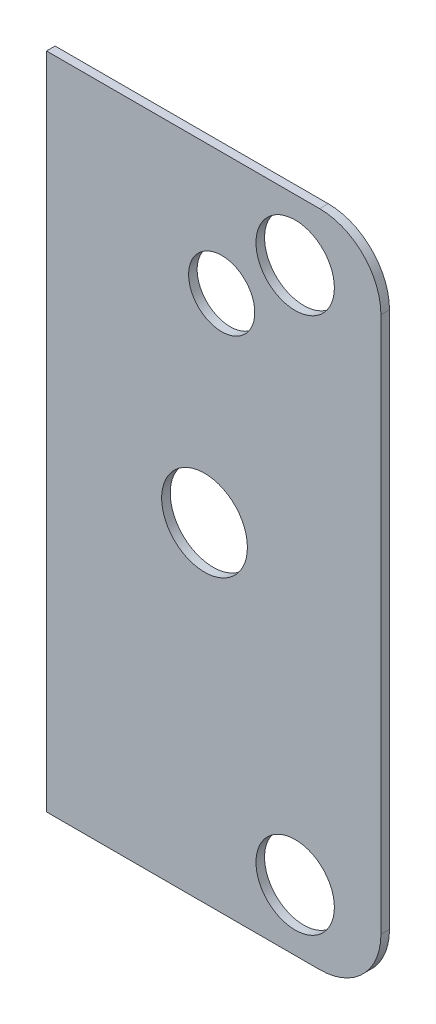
from build123d import *

# Parameters (mm, degrees)
SKETCH_1_W           = 76
SKETCH_1_H           = 60
EXTRUDE_1_DEPTH      = 0.7
SKETCH_5_W           = 76
SKETCH_5_H           = 60
CUT_EXTRUDE_4_DEPTH  = 10
CUT_EXTRUDE_8_DEPTH  = 0.7
SKETCH_17_R          = 2.5
CUT_EXTRUDE_9_DEPTH  = 45.069377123
SKETCH_29_R          = 3
EXTRUDE_3_DEPTH      = 0.6
CUT_EXTRUDE_18_DEPTH = 5
SKETCH_34_R          = 3.5
SKETCH_34_R_2        = 3
CUT_EXTRUDE_31_DEPTH = 10
CUT_EXTRUDE_34_DEPTH = 10
SKETCH_42_R          = 3.2
CUT_EXTRUDE_35_DEPTH = 10
CUT_EXTRUDE_36_DEPTH = 10
SKETCH_44_R          = 3
CUT_EXTRUDE_37_DEPTH = 10
SKETCH_35_R          = 2.7
CUT_EXTRUDE_38_DEPTH = 45.069377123


with BuildPart() as part:
    # Sketch 1 → Extrude 1 (new body)
    with BuildSketch(Plane.XY):
        Rectangle(SKETCH_1_W, SKETCH_1_H)
    extrude(amount=EXTRUDE_1_DEPTH)

    # Sketch 5 → Cut-Extrude 4 (cut)
    with BuildSketch(Plane.XY.offset(0.7)):
        Rectangle(SKETCH_5_W, SKETCH_5_H)
        with BuildLine():
            Line((-34.9, 21.9), (-34.9, -21.9))
            ThreePointArc((-34.9, -21.9), (-33.435533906, -25.435533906), (-29.9, -26.9))
            Line((-29.9, -26.9), (29.9, -26.9))
            ThreePointArc((29.9, -26.9), (33.435533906, -25.435533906), (34.9, -21.9))
            Line((34.9, -21.9), (34.9, 21.9))
            ThreePointArc((34.9, 21.9), (33.435533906, 25.435533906), (29.9, 26.9))
            Line((29.9, 26.9), (-29.9, 26.9))
            ThreePointArc((-29.9, 26.9), (-33.435533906, 25.435533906), (-34.9, 21.9))
        make_face(mode=Mode.SUBTRACT)
    extrude(amount=-CUT_EXTRUDE_4_DEPTH, mode=Mode.SUBTRACT)

    # Sketch 13 → Cut-Extrude 8 (cut)
    with BuildSketch(Plane.XY.offset(0.7)):
        with BuildLine():
            Line((0.357380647, 0.004961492), (6.196219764, 1.051194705))
            ThreePointArc((6.196219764, 1.051194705), (6.528171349, 1.272279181), (6.592796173, 1.665844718))
            ThreePointArc((6.592796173, 1.665844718), (3.4, 5.888972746), (-1.853734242, 6.542451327))
            ThreePointArc((-1.853734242, 6.542451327), (-2.162259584, 6.289701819), (-2.187748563, 5.891681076))
            Line((-2.187748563, 5.891681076), (-0.174393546, 0.311981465))
            ThreePointArc((-0.174393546, 0.311981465), (-0.1765, 0.305706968), (-0.182987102, 0.307019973))
            Line((-0.182987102, 0.307019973), (-4.008471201, 4.84048637))
            ThreePointArc((-4.008471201, 4.84048637), (-4.365911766, 5.017422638), (-4.739061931, 4.876606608))
            ThreePointArc((-4.739061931, 4.876606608), (-6.8, 0), (-4.739061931, -4.876606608))
            ThreePointArc((-4.739061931, -4.876606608), (-4.365911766, -5.017422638), (-4.008471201, -4.84048637))
            Line((-4.008471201, -4.84048637), (-0.182987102, -0.307019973))
            ThreePointArc((-0.182987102, -0.307019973), (-0.1765, -0.305706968), (-0.174393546, -0.311981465))
            Line((-0.174393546, -0.311981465), (-2.187748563, -5.891681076))
            ThreePointArc((-2.187748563, -5.891681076), (-2.162259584, -6.289701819), (-1.853734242, -6.542451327))
            ThreePointArc((-1.853734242, -6.542451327), (3.4, -5.888972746), (6.592796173, -1.665844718))
            ThreePointArc((6.592796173, -1.665844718), (6.528171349, -1.272279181), (6.196219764, -1.051194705))
            Line((6.196219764, -1.051194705), (0.357380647, -0.004961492))
            ThreePointArc((0.357380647, -0.004961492), (0.353, 0), (0.357380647, 0.004961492))
        make_face()
    extrude(amount=-CUT_EXTRUDE_8_DEPTH, mode=Mode.SUBTRACT)

    # Sketch 17 → Cut-Extrude 9 (cut, through all)
    with BuildSketch(Plane.XY.offset(0.7)):
        with Locations((-21.9, 16.9)):
            Circle(SKETCH_17_R)
        with Locations(Location((21.9, 16.9, 0), (0, 0, 180))):
            Circle(SKETCH_17_R)
        with Locations((-21.9, -19.4)):
            Circle(SKETCH_17_R)
    extrude(amount=-CUT_EXTRUDE_9_DEPTH, mode=Mode.SUBTRACT)

    # Sketch 29 → Extrude 3 (add)
    with BuildSketch(Plane.XY.offset(0.7)):
        with Locations((-27.9, 21.9)):
            Circle(SKETCH_29_R)
        with Locations(Location((27.9, 21.9, 0), (0, 0, 180))):
            Circle(SKETCH_29_R)
        with Locations((27.9, -21.9)):
            Circle(SKETCH_29_R)
        with Locations(Location((-27.9, -21.9, 0), (0, 0, 180))):
            Circle(SKETCH_29_R)
    extrude(amount=EXTRUDE_3_DEPTH)

    # Sketch 31 → Cut-Extrude 18 (cut, symmetric)
    with BuildSketch(Plane.XY.offset(0.7)):
        with BuildLine():
            ThreePointArc((5, 37.5), (4.267766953, 39.267766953), (2.5, 40))
            Line((2.5, 40), (-2.5, 40))
            ThreePointArc((-2.5, 40), (-4.267766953, 39.267766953), (-5, 37.5))
            Line((-5, 37.5), (-5, 26.9))
            Line((-5, 26.9), (5, 26.9))
            Line((5, 26.9), (5, 37.5))
        make_face()
        with BuildLine():
            Line((5, 4.608687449), (5, 26.9))
            Line((5, 26.9), (-5, 26.9))
            Line((-5, 26.9), (-5, 4.608687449))
            ThreePointArc((-5, 4.608687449), (-4.871373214, 4.744441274), (-4.739061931, 4.876606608))
            ThreePointArc((-4.739061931, 4.876606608), (-4.365911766, 5.017422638), (-4.008471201, 4.84048637))
            Line((-4.008471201, 4.84048637), (-0.182987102, 0.307019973))
            ThreePointArc((-0.182987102, 0.307019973), (-0.1765, 0.305706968), (-0.174393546, 0.311981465))
            Line((-0.174393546, 0.311981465), (-2.187748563, 5.891681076))
            ThreePointArc((-2.187748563, 5.891681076), (-2.162259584, 6.289701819), (-1.853734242, 6.542451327))
            ThreePointArc((-1.853734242, 6.542451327), (1.846512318, 6.544493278), (5, 4.608687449))
        make_face()
        with BuildLine():
            Line((5, 0.836849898), (5, 4.608687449))
            ThreePointArc((5, 4.608687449), (1.846512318, 6.544493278), (-1.853734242, 6.542451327))
            ThreePointArc((-1.853734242, 6.542451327), (-2.162259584, 6.289701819), (-2.187748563, 5.891681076))
            Line((-2.187748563, 5.891681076), (-0.174393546, 0.311981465))
            ThreePointArc((-0.174393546, 0.311981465), (-0.1765, 0.305706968), (-0.182987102, 0.307019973))
            Line((-0.182987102, 0.307019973), (-4.008471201, 4.84048637))
            ThreePointArc((-4.008471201, 4.84048637), (-4.365911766, 5.017422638), (-4.739061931, 4.876606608))
            ThreePointArc((-4.739061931, 4.876606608), (-4.871373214, 4.744441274), (-5, 4.608687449))
            Line((-5, 4.608687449), (-5, 0))
            Line((-5, 0), (0, 0))
            Line((0, 0), (0.353, 0))
            ThreePointArc((0.353, 0), (0.354251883, 0.003309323), (0.357380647, 0.004961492))
            Line((0.357380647, 0.004961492), (5, 0.836849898))
        make_face()
        with BuildLine():
            ThreePointArc((-4.739061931, -4.876606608), (-4.871373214, -4.744441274), (-5, -4.608687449))
            Line((-5, -4.608687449), (-5, -26.9))
            Line((-5, -26.9), (5, -26.9))
            Line((5, -26.9), (5, -4.608687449))
            ThreePointArc((5, -4.608687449), (1.846512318, -6.544493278), (-1.853734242, -6.542451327))
            ThreePointArc((-1.853734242, -6.542451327), (-2.162259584, -6.289701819), (-2.187748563, -5.891681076))
            Line((-2.187748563, -5.891681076), (-0.174393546, -0.311981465))
            ThreePointArc((-0.174393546, -0.311981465), (-0.1765, -0.305706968), (-0.182987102, -0.307019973))
            Line((-0.182987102, -0.307019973), (-4.008471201, -4.84048637))
            ThreePointArc((-4.008471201, -4.84048637), (-4.365911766, -5.017422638), (-4.739061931, -4.876606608))
        make_face()
        with BuildLine():
            Line((0, 0), (-5, 0))
            Line((-5, 0), (-5, -4.608687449))
            ThreePointArc((-5, -4.608687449), (-4.871373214, -4.744441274), (-4.739061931, -4.876606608))
            ThreePointArc((-4.739061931, -4.876606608), (-4.365911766, -5.017422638), (-4.008471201, -4.84048637))
            Line((-4.008471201, -4.84048637), (-0.182987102, -0.307019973))
            ThreePointArc((-0.182987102, -0.307019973), (-0.1765, -0.305706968), (-0.174393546, -0.311981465))
            Line((-0.174393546, -0.311981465), (-2.187748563, -5.891681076))
            ThreePointArc((-2.187748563, -5.891681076), (-2.162259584, -6.289701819), (-1.853734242, -6.542451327))
            ThreePointArc((-1.853734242, -6.542451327), (1.846512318, -6.544493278), (5, -4.608687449))
            Line((5, -4.608687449), (5, -0.836849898))
            Line((5, -0.836849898), (0.357380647, -0.004961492))
            ThreePointArc((0.357380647, -0.004961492), (0.354251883, -0.003309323), (0.353, 0))
            Line((0.353, 0), (0, 0))
        make_face()
        with BuildLine():
            Line((5, -26.9), (-5, -26.9))
            Line((-5, -26.9), (-5, -37.5))
            ThreePointArc((-5, -37.5), (-4.267766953, -39.267766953), (-2.5, -40))
            Line((-2.5, -40), (2.5, -40))
            ThreePointArc((2.5, -40), (4.267766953, -39.267766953), (5, -37.5))
            Line((5, -37.5), (5, -26.9))
        make_face()
    extrude(amount=CUT_EXTRUDE_18_DEPTH, both=True, mode=Mode.SUBTRACT)


with BuildPart() as cut_extrude_18_piece_1:
    # of the separate pieces the step leaves, piece 1, a body of its own (cut_extrude_18_pieces)
    add(part.part.solids().sort_by_distance((34.9, 21.9, 0))[0])


with BuildPart() as cut_extrude_18_piece_2:
    # of the separate pieces the step leaves, piece 2, a body of its own (cut_extrude_18_pieces)
    add(part.part.solids().sort_by_distance((-29.9, 26.9, 0))[0])


with BuildPart() as cut_extrude_31_tool:
    # Sketch 34 → Cut-Extrude 31 (new body)
    with BuildSketch(Plane.XY.offset(0.7)):
        with Locations((20.5, 0)):
            Circle(SKETCH_34_R)
        with Locations((-10.25, 17.753520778)):
            Circle(SKETCH_34_R_2)
        with Locations((-10.25, -17.753520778)):
            Circle(SKETCH_34_R_2)
    extrude(amount=-CUT_EXTRUDE_31_DEPTH)


with BuildPart() as cut_extrude_18_piece_1_1:
    add(cut_extrude_18_piece_1.part)

    # Cut-Extrude 31: cut by cut_extrude_31_tool
    add(cut_extrude_31_tool.part, mode=Mode.SUBTRACT)

    # Sketch 42 → Cut-Extrude 35 (cut)
    with BuildSketch(Plane.XY.offset(1.3)):
        with Locations((27.9, 21.9)):
            Circle(SKETCH_42_R)
        with Locations((27.9, -21.9)):
            Circle(SKETCH_42_R)
    extrude(amount=-CUT_EXTRUDE_35_DEPTH, mode=Mode.SUBTRACT)

    # Sketch 43 → Cut-Extrude 36 (cut)
    with BuildSketch(Plane.XY.offset(0.7)):
        with BuildLine():
            Line((7.6, 4.608687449), (7.6, 26.9))
            Line((7.6, 26.9), (5, 26.9))
            Line((5, 26.9), (5, 4.608687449))
            ThreePointArc((5, 4.608687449), (5.980243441, 3.236771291), (6.592796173, 1.665844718))
            ThreePointArc((6.592796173, 1.665844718), (6.528171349, 1.272279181), (6.196219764, 1.051194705))
            Line((6.196219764, 1.051194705), (0.357380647, 0.004961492))
            ThreePointArc((0.357380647, 0.004961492), (0.353, 0), (0.357380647, -0.004961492))
            Line((0.357380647, -0.004961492), (6.196219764, -1.051194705))
            ThreePointArc((6.196219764, -1.051194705), (6.528171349, -1.272279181), (6.592796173, -1.665844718))
            ThreePointArc((6.592796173, -1.665844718), (5.980243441, -3.236771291), (5, -4.608687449))
            Line((5, -4.608687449), (5, -26.9))
            Line((5, -26.9), (7.6, -26.9))
            Line((7.6, -26.9), (7.6, -4.608687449))
            Line((7.6, -4.608687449), (7.6, 4.608687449))
        make_face()
    extrude(amount=-CUT_EXTRUDE_36_DEPTH, mode=Mode.SUBTRACT)

    # Sketch 35 → Cut-Extrude 38 (cut, through all)
    with BuildSketch(Plane.XY.offset(0.7)):
        with Locations((21.9, 16.9)):
            Circle(SKETCH_35_R)
    extrude(amount=-CUT_EXTRUDE_38_DEPTH, mode=Mode.SUBTRACT)


with BuildPart() as cut_extrude_18_piece_2_1:
    add(cut_extrude_18_piece_2.part)

    # Cut-Extrude 31: cut by cut_extrude_31_tool
    add(cut_extrude_31_tool.part, mode=Mode.SUBTRACT)

    # Sketch 41 → Cut-Extrude 34 (cut)
    with BuildSketch(Plane.XY.offset(0.7)):
        with BuildLine():
            Line((-5, 4.608687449), (-5, 26.9))
            Line((-5, 26.9), (-29.9, 26.9))
            ThreePointArc((-29.9, 26.9), (-33.435533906, 25.435533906), (-34.9, 21.9))
            Line((-34.9, 21.9), (-34.9, -21.9))
            ThreePointArc((-34.9, -21.9), (-33.435533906, -25.435533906), (-29.9, -26.9))
            Line((-29.9, -26.9), (-5, -26.9))
            Line((-5, -26.9), (-5, -4.608687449))
            ThreePointArc((-5, -4.608687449), (-6.8, 0), (-5, 4.608687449))
        make_face()
    extrude(amount=-CUT_EXTRUDE_34_DEPTH, mode=Mode.SUBTRACT)


with BuildPart() as cut_extrude_34_piece_1:
    # of the separate pieces the step leaves, piece 1, a body of its own (cut_extrude_34_pieces)
    add(cut_extrude_18_piece_2_1.part.solids().sort_by_distance((-30.9, -21.9, 0.7))[0])


with BuildPart() as cut_extrude_34_piece_2:
    # of the separate pieces the step leaves, piece 2, a body of its own (cut_extrude_34_pieces)
    add(cut_extrude_18_piece_2_1.part.solids().sort_by_distance((-24.9, 21.9, 0.7))[0])


with BuildPart() as cut_extrude_37_tool:
    # Sketch 44 → Cut-Extrude 37 (new body)
    with BuildSketch(Plane.XY.offset(1.3)):
        with Locations((-27.9, 21.9)):
            Circle(SKETCH_44_R)
        with Locations((-27.9, -21.9)):
            Circle(SKETCH_44_R)
    extrude(amount=-CUT_EXTRUDE_37_DEPTH)


with BuildPart() as cut_extrude_34_piece_1_1:
    add(cut_extrude_34_piece_1.part)

    # Cut-Extrude 37: cut by cut_extrude_37_tool
    add(cut_extrude_37_tool.part, mode=Mode.SUBTRACT)


with BuildPart() as cut_extrude_34_piece_2_1:
    add(cut_extrude_34_piece_2.part)

    # Cut-Extrude 37: cut by cut_extrude_37_tool
    add(cut_extrude_37_tool.part, mode=Mode.SUBTRACT)


solid = cut_extrude_18_piece_1_1.part
